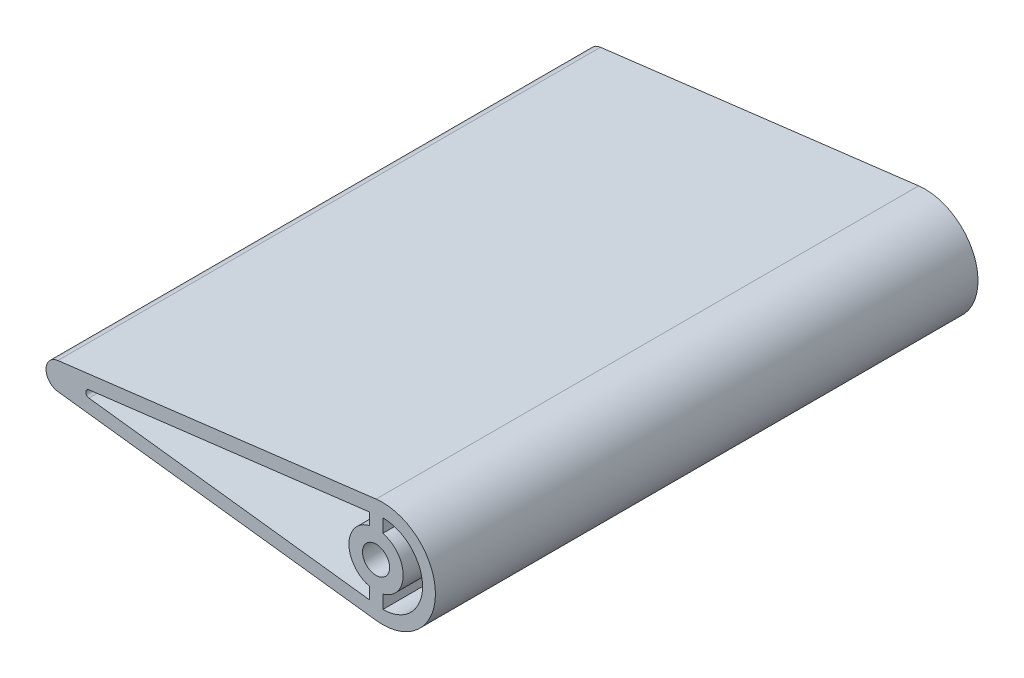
ISO-10303-21;
HEADER;
FILE_DESCRIPTION(('STEP AP214'),'2;1');
FILE_NAME('part.step','',(''),(''),'','','');
FILE_SCHEMA(('AUTOMOTIVE_DESIGN { 1 0 10303 214 1 1 1 1 }'));
ENDSEC;
DATA;
#1=APPLICATION_CONTEXT('core data for automotive mechanical design processes');
#2=APPLICATION_PROTOCOL_DEFINITION('international standard','automotive_design',2000,#1);
#3=PRODUCT_CONTEXT('',#1,'mechanical');
#4=PRODUCT('Part','Part','',(#3));
#5=PRODUCT_RELATED_PRODUCT_CATEGORY('part','',(#4));
#6=PRODUCT_DEFINITION_FORMATION('','',#4);
#7=PRODUCT_DEFINITION_CONTEXT('part definition',#1,'design');
#8=PRODUCT_DEFINITION('design','',#6,#7);
#9=PRODUCT_DEFINITION_SHAPE('','',#8);
#10=(LENGTH_UNIT() NAMED_UNIT(*) SI_UNIT(.MILLI.,.METRE.));
#11=(NAMED_UNIT(*) PLANE_ANGLE_UNIT() SI_UNIT($,.RADIAN.));
#12=(NAMED_UNIT(*) SI_UNIT($,.STERADIAN.) SOLID_ANGLE_UNIT());
#13=UNCERTAINTY_MEASURE_WITH_UNIT(LENGTH_MEASURE(1.E-05),#10,'distance_accuracy_value','');
#14=(GEOMETRIC_REPRESENTATION_CONTEXT(3) GLOBAL_UNCERTAINTY_ASSIGNED_CONTEXT((#13)) GLOBAL_UNIT_ASSIGNED_CONTEXT((#10,
#11,#12)) REPRESENTATION_CONTEXT('',''));
#15=CARTESIAN_POINT('',(0.,0.,0.));
#16=DIRECTION('',(0.,0.,1.));
#17=DIRECTION('',(1.,0.,0.));
#18=AXIS2_PLACEMENT_3D('',#15,#16,#17);
#19=CARTESIAN_POINT('',(1.42644334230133,0.,120.));
#20=DIRECTION('',(0.,0.,-1.));
#21=DIRECTION('',(-1.,0.,0.));
#22=AXIS2_PLACEMENT_3D('',#19,#20,#21);
#23=PLANE('',#22);
#24=CARTESIAN_POINT('',(0.,0.,120.));
#25=DIRECTION('',(0.,0.,1.));
#26=DIRECTION('',(-1.,0.,0.));
#27=AXIS2_PLACEMENT_3D('',#24,#25,#26);
#28=CIRCLE('',#27,3.);
#29=CARTESIAN_POINT('',(-3.,0.,120.));
#30=VERTEX_POINT('',#29);
#31=EDGE_CURVE('E173',#30,#30,#28,.T.);
#32=ORIENTED_EDGE('',*,*,#31,.F.);
#33=EDGE_LOOP('',(#32));
#34=FACE_BOUND('',#33,.T.);
#35=DIRECTION('',(-0.992546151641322,-0.121869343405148,0.));
#36=VECTOR('',#35,1.);
#37=CARTESIAN_POINT('',(-94.6165271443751,0.,120.));
#38=LINE('',#37,#36);
#39=CARTESIAN_POINT('',(0.,11.6174487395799,120.));
#40=VERTEX_POINT('',#39);
#41=CARTESIAN_POINT('',(-70.3656080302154,2.97763845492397,120.));
#42=VERTEX_POINT('',#41);
#43=EDGE_CURVE('E227',#40,#42,#38,.T.);
#44=ORIENTED_EDGE('',*,*,#43,.T.);
#45=CARTESIAN_POINT('',(-70.,0.,120.));
#46=DIRECTION('',(0.,0.,-1.));
#47=DIRECTION('',(-1.,0.,0.));
#48=AXIS2_PLACEMENT_3D('',#45,#46,#47);
#49=CIRCLE('',#48,3.);
#50=CARTESIAN_POINT('',(-70.3656080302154,-2.97763845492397,120.));
#51=VERTEX_POINT('',#50);
#52=EDGE_CURVE('E11',#42,#51,#49,.F.);
#53=ORIENTED_EDGE('',*,*,#52,.T.);
#54=DIRECTION('',(0.992546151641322,-0.121869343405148,0.));
#55=VECTOR('',#54,1.);
#56=CARTESIAN_POINT('',(-94.6165271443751,0.,120.));
#57=LINE('',#56,#55);
#58=CARTESIAN_POINT('',(0.,-11.6174487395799,120.));
#59=VERTEX_POINT('',#58);
#60=EDGE_CURVE('E230',#51,#59,#57,.T.);
#61=ORIENTED_EDGE('',*,*,#60,.T.);
#62=CARTESIAN_POINT('',(1.42644334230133,0.,120.));
#63=DIRECTION('',(0.,0.,1.));
#64=DIRECTION('',(-1.,0.,0.));
#65=AXIS2_PLACEMENT_3D('',#62,#63,#64);
#66=CIRCLE('',#65,11.7046937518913);
#67=EDGE_CURVE('E224',#59,#40,#66,.T.);
#68=ORIENTED_EDGE('',*,*,#67,.T.);
#69=EDGE_LOOP('',(#44,#53,#61,#68));
#70=FACE_BOUND('',#69,.T.);
#71=CARTESIAN_POINT('',(-63.3803395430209,0.,120.));
#72=DIRECTION('',(0.,0.,1.));
#73=DIRECTION('',(-1.,0.,0.));
#74=AXIS2_PLACEMENT_3D('',#71,#72,#73);
#75=CIRCLE('',#74,0.806945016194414);
#76=CARTESIAN_POINT('',(-63.496985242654,0.79846981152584,120.));
#77=VERTEX_POINT('',#76);
#78=CARTESIAN_POINT('',(-63.496985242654,-0.79846981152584,120.));
#79=VERTEX_POINT('',#78);
#80=EDGE_CURVE('E179',#77,#79,#75,.T.);
#81=ORIENTED_EDGE('',*,*,#80,.F.);
#82=DIRECTION('',(-0.992546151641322,-0.121869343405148,0.));
#83=VECTOR('',#82,1.);
#84=CARTESIAN_POINT('',(-63.496985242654,0.79846981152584,120.));
#85=LINE('',#84,#83);
#86=CARTESIAN_POINT('',(-1.5,8.41074242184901,120.));
#87=VERTEX_POINT('',#86);
#88=EDGE_CURVE('E191',#87,#77,#85,.T.);
#89=ORIENTED_EDGE('',*,*,#88,.F.);
#90=DIRECTION('',(0.,1.,0.));
#91=VECTOR('',#90,1.);
#92=CARTESIAN_POINT('',(-1.5,8.41074242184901,120.));
#93=LINE('',#92,#91);
#94=CARTESIAN_POINT('',(-1.5,5.80947501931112,120.));
#95=VERTEX_POINT('',#94);
#96=EDGE_CURVE('E188',#95,#87,#93,.T.);
#97=ORIENTED_EDGE('',*,*,#96,.F.);
#98=CARTESIAN_POINT('',(0.,0.,120.));
#99=DIRECTION('',(0.,0.,-1.));
#100=DIRECTION('',(1.,0.,0.));
#101=AXIS2_PLACEMENT_3D('',#98,#99,#100);
#102=CIRCLE('',#101,6.00000000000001);
#103=CARTESIAN_POINT('',(-1.50000000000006,-5.80947501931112,120.));
#104=VERTEX_POINT('',#103);
#105=EDGE_CURVE('E186',#104,#95,#102,.T.);
#106=ORIENTED_EDGE('',*,*,#105,.F.);
#107=DIRECTION('',(0.,1.,0.));
#108=VECTOR('',#107,1.);
#109=CARTESIAN_POINT('',(-1.50000000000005,-8.41074242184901,120.));
#110=LINE('',#109,#108);
#111=CARTESIAN_POINT('',(-1.50000000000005,-8.41074242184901,120.));
#112=VERTEX_POINT('',#111);
#113=EDGE_CURVE('E184',#112,#104,#110,.T.);
#114=ORIENTED_EDGE('',*,*,#113,.F.);
#115=DIRECTION('',(0.992546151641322,-0.121869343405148,0.));
#116=VECTOR('',#115,1.);
#117=CARTESIAN_POINT('',(-63.496985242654,-0.79846981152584,120.));
#118=LINE('',#117,#116);
#119=EDGE_CURVE('E181',#79,#112,#118,.T.);
#120=ORIENTED_EDGE('',*,*,#119,.F.);
#121=EDGE_LOOP('',(#81,#89,#97,#106,#114,#120));
#122=FACE_BOUND('',#121,.T.);
#123=CARTESIAN_POINT('',(1.49999999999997,0.,120.));
#124=DIRECTION('',(0.,0.,1.));
#125=DIRECTION('',(1.,0.,0.));
#126=AXIS2_PLACEMENT_3D('',#123,#124,#125);
#127=CIRCLE('',#126,8.77909610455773);
#128=CARTESIAN_POINT('',(1.49999999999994,-8.77909610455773,120.));
#129=VERTEX_POINT('',#128);
#130=CARTESIAN_POINT('',(1.5,8.77909610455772,120.));
#131=VERTEX_POINT('',#130);
#132=EDGE_CURVE('E132',#129,#131,#127,.T.);
#133=ORIENTED_EDGE('',*,*,#132,.F.);
#134=DIRECTION('',(0.,-1.,0.));
#135=VECTOR('',#134,1.);
#136=CARTESIAN_POINT('',(1.49999999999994,-8.77909610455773,120.));
#137=LINE('',#136,#135);
#138=CARTESIAN_POINT('',(1.49999999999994,-5.80947501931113,120.));
#139=VERTEX_POINT('',#138);
#140=EDGE_CURVE('E157',#139,#129,#137,.T.);
#141=ORIENTED_EDGE('',*,*,#140,.F.);
#142=CARTESIAN_POINT('',(0.,0.,120.));
#143=DIRECTION('',(0.,0.,-1.));
#144=DIRECTION('',(1.,0.,0.));
#145=AXIS2_PLACEMENT_3D('',#142,#143,#144);
#146=CIRCLE('',#145,5.99999999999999);
#147=CARTESIAN_POINT('',(1.5,5.80947501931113,120.));
#148=VERTEX_POINT('',#147);
#149=EDGE_CURVE('E155',#148,#139,#146,.T.);
#150=ORIENTED_EDGE('',*,*,#149,.F.);
#151=DIRECTION('',(0.,-1.,0.));
#152=VECTOR('',#151,1.);
#153=CARTESIAN_POINT('',(1.5,8.77909610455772,120.));
#154=LINE('',#153,#152);
#155=EDGE_CURVE('E142',#131,#148,#154,.T.);
#156=ORIENTED_EDGE('',*,*,#155,.F.);
#157=EDGE_LOOP('',(#133,#141,#150,#156));
#158=FACE_BOUND('',#157,.T.);
#159=ADVANCED_FACE('F32',(#34,#70,#122,#158),#23,.F.);
#160=CARTESIAN_POINT('',(1.42644334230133,0.,0.));
#161=DIRECTION('',(0.,0.,-1.));
#162=DIRECTION('',(-1.,0.,0.));
#163=AXIS2_PLACEMENT_3D('',#160,#161,#162);
#164=PLANE('',#163);
#165=CARTESIAN_POINT('',(0.,0.,0.));
#166=DIRECTION('',(0.,0.,1.));
#167=DIRECTION('',(-1.,0.,0.));
#168=AXIS2_PLACEMENT_3D('',#165,#166,#167);
#169=CIRCLE('',#168,3.);
#170=CARTESIAN_POINT('',(-3.,0.,0.));
#171=VERTEX_POINT('',#170);
#172=EDGE_CURVE('E150',#171,#171,#169,.T.);
#173=ORIENTED_EDGE('',*,*,#172,.T.);
#174=EDGE_LOOP('',(#173));
#175=FACE_BOUND('',#174,.T.);
#176=DIRECTION('',(0.992546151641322,-0.121869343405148,0.));
#177=VECTOR('',#176,1.);
#178=CARTESIAN_POINT('',(-94.6165271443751,0.,0.));
#179=LINE('',#178,#177);
#180=CARTESIAN_POINT('',(-70.3656080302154,-2.97763845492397,0.));
#181=VERTEX_POINT('',#180);
#182=CARTESIAN_POINT('',(0.,-11.6174487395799,0.));
#183=VERTEX_POINT('',#182);
#184=EDGE_CURVE('E228',#181,#183,#179,.T.);
#185=ORIENTED_EDGE('',*,*,#184,.F.);
#186=CARTESIAN_POINT('',(-70.,0.,0.));
#187=DIRECTION('',(0.,0.,-1.));
#188=DIRECTION('',(-1.,0.,0.));
#189=AXIS2_PLACEMENT_3D('',#186,#187,#188);
#190=CIRCLE('',#189,3.);
#191=CARTESIAN_POINT('',(-70.3656080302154,2.97763845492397,0.));
#192=VERTEX_POINT('',#191);
#193=EDGE_CURVE('E54',#181,#192,#190,.T.);
#194=ORIENTED_EDGE('',*,*,#193,.T.);
#195=DIRECTION('',(-0.992546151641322,-0.121869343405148,0.));
#196=VECTOR('',#195,1.);
#197=CARTESIAN_POINT('',(-94.6165271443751,0.,0.));
#198=LINE('',#197,#196);
#199=CARTESIAN_POINT('',(0.,11.6174487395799,0.));
#200=VERTEX_POINT('',#199);
#201=EDGE_CURVE('E235',#200,#192,#198,.T.);
#202=ORIENTED_EDGE('',*,*,#201,.F.);
#203=CARTESIAN_POINT('',(1.42644334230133,0.,0.));
#204=DIRECTION('',(0.,0.,1.));
#205=DIRECTION('',(-1.,0.,0.));
#206=AXIS2_PLACEMENT_3D('',#203,#204,#205);
#207=CIRCLE('',#206,11.7046937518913);
#208=EDGE_CURVE('E223',#183,#200,#207,.T.);
#209=ORIENTED_EDGE('',*,*,#208,.F.);
#210=EDGE_LOOP('',(#185,#194,#202,#209));
#211=FACE_BOUND('',#210,.T.);
#212=DIRECTION('',(-0.992546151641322,-0.121869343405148,0.));
#213=VECTOR('',#212,1.);
#214=CARTESIAN_POINT('',(-63.496985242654,0.79846981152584,0.));
#215=LINE('',#214,#213);
#216=CARTESIAN_POINT('',(-1.5,8.41074242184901,0.));
#217=VERTEX_POINT('',#216);
#218=CARTESIAN_POINT('',(-63.496985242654,0.798469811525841,0.));
#219=VERTEX_POINT('',#218);
#220=EDGE_CURVE('E182',#217,#219,#215,.T.);
#221=ORIENTED_EDGE('',*,*,#220,.T.);
#222=CARTESIAN_POINT('',(-63.3803395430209,0.,0.));
#223=DIRECTION('',(0.,0.,1.));
#224=DIRECTION('',(-1.,0.,0.));
#225=AXIS2_PLACEMENT_3D('',#222,#223,#224);
#226=CIRCLE('',#225,0.806945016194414);
#227=CARTESIAN_POINT('',(-63.496985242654,-0.79846981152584,0.));
#228=VERTEX_POINT('',#227);
#229=EDGE_CURVE('E176',#219,#228,#226,.T.);
#230=ORIENTED_EDGE('',*,*,#229,.T.);
#231=DIRECTION('',(0.992546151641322,-0.121869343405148,0.));
#232=VECTOR('',#231,1.);
#233=CARTESIAN_POINT('',(-63.496985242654,-0.79846981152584,0.));
#234=LINE('',#233,#232);
#235=CARTESIAN_POINT('',(-1.50000000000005,-8.41074242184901,0.));
#236=VERTEX_POINT('',#235);
#237=EDGE_CURVE('E196',#228,#236,#234,.T.);
#238=ORIENTED_EDGE('',*,*,#237,.T.);
#239=DIRECTION('',(0.,1.,0.));
#240=VECTOR('',#239,1.);
#241=CARTESIAN_POINT('',(-1.50000000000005,-8.41074242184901,0.));
#242=LINE('',#241,#240);
#243=CARTESIAN_POINT('',(-1.50000000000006,-5.80947501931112,0.));
#244=VERTEX_POINT('',#243);
#245=EDGE_CURVE('E199',#236,#244,#242,.T.);
#246=ORIENTED_EDGE('',*,*,#245,.T.);
#247=CARTESIAN_POINT('',(0.,0.,0.));
#248=DIRECTION('',(0.,0.,-1.));
#249=DIRECTION('',(1.,0.,0.));
#250=AXIS2_PLACEMENT_3D('',#247,#248,#249);
#251=CIRCLE('',#250,6.00000000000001);
#252=CARTESIAN_POINT('',(-1.5,5.80947501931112,0.));
#253=VERTEX_POINT('',#252);
#254=EDGE_CURVE('E202',#244,#253,#251,.T.);
#255=ORIENTED_EDGE('',*,*,#254,.T.);
#256=DIRECTION('',(0.,1.,0.));
#257=VECTOR('',#256,1.);
#258=CARTESIAN_POINT('',(-1.5,8.41074242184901,0.));
#259=LINE('',#258,#257);
#260=EDGE_CURVE('E205',#253,#217,#259,.T.);
#261=ORIENTED_EDGE('',*,*,#260,.T.);
#262=EDGE_LOOP('',(#221,#230,#238,#246,#255,#261));
#263=FACE_BOUND('',#262,.T.);
#264=DIRECTION('',(0.,-1.,0.));
#265=VECTOR('',#264,1.);
#266=CARTESIAN_POINT('',(1.49999999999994,-8.77909610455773,0.));
#267=LINE('',#266,#265);
#268=CARTESIAN_POINT('',(1.49999999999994,-5.80947501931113,0.));
#269=VERTEX_POINT('',#268);
#270=CARTESIAN_POINT('',(1.49999999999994,-8.77909610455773,0.));
#271=VERTEX_POINT('',#270);
#272=EDGE_CURVE('E143',#269,#271,#267,.T.);
#273=ORIENTED_EDGE('',*,*,#272,.T.);
#274=CARTESIAN_POINT('',(1.49999999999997,0.,0.));
#275=DIRECTION('',(0.,0.,1.));
#276=DIRECTION('',(1.,0.,0.));
#277=AXIS2_PLACEMENT_3D('',#274,#275,#276);
#278=CIRCLE('',#277,8.77909610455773);
#279=CARTESIAN_POINT('',(1.5,8.77909610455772,0.));
#280=VERTEX_POINT('',#279);
#281=EDGE_CURVE('E161',#271,#280,#278,.T.);
#282=ORIENTED_EDGE('',*,*,#281,.T.);
#283=DIRECTION('',(0.,-1.,0.));
#284=VECTOR('',#283,1.);
#285=CARTESIAN_POINT('',(1.5,8.77909610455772,0.));
#286=LINE('',#285,#284);
#287=CARTESIAN_POINT('',(1.5,5.80947501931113,0.));
#288=VERTEX_POINT('',#287);
#289=EDGE_CURVE('E149',#280,#288,#286,.T.);
#290=ORIENTED_EDGE('',*,*,#289,.T.);
#291=CARTESIAN_POINT('',(0.,0.,0.));
#292=DIRECTION('',(0.,0.,-1.));
#293=DIRECTION('',(1.,0.,0.));
#294=AXIS2_PLACEMENT_3D('',#291,#292,#293);
#295=CIRCLE('',#294,5.99999999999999);
#296=EDGE_CURVE('E164',#288,#269,#295,.T.);
#297=ORIENTED_EDGE('',*,*,#296,.T.);
#298=EDGE_LOOP('',(#273,#282,#290,#297));
#299=FACE_BOUND('',#298,.T.);
#300=ADVANCED_FACE('F254',(#175,#211,#263,#299),#164,.T.);
#301=CARTESIAN_POINT('',(1.42644334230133,0.,120.));
#302=DIRECTION('',(0.,0.,-1.));
#303=DIRECTION('',(-1.,0.,0.));
#304=AXIS2_PLACEMENT_3D('',#301,#302,#303);
#305=CYLINDRICAL_SURFACE('',#304,11.7046937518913);
#306=ORIENTED_EDGE('',*,*,#208,.T.);
#307=DIRECTION('',(0.,0.,-1.));
#308=VECTOR('',#307,1.);
#309=CARTESIAN_POINT('',(0.,11.6174487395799,120.));
#310=LINE('',#309,#308);
#311=EDGE_CURVE('E240',#40,#200,#310,.T.);
#312=ORIENTED_EDGE('',*,*,#311,.F.);
#313=ORIENTED_EDGE('',*,*,#67,.F.);
#314=DIRECTION('',(0.,0.,-1.));
#315=VECTOR('',#314,1.);
#316=CARTESIAN_POINT('',(0.,-11.6174487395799,120.));
#317=LINE('',#316,#315);
#318=EDGE_CURVE('E232',#59,#183,#317,.T.);
#319=ORIENTED_EDGE('',*,*,#318,.T.);
#320=EDGE_LOOP('',(#306,#312,#313,#319));
#321=FACE_BOUND('',#320,.T.);
#322=ADVANCED_FACE('F258',(#321),#305,.T.);
#323=CARTESIAN_POINT('',(-94.6165271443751,0.,120.));
#324=DIRECTION('',(0.121869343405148,-0.992546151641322,0.));
#325=DIRECTION('',(0.992546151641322,0.121869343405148,0.));
#326=AXIS2_PLACEMENT_3D('',#323,#324,#325);
#327=PLANE('',#326);
#328=ORIENTED_EDGE('',*,*,#201,.T.);
#329=DIRECTION('',(0.,0.,-1.));
#330=VECTOR('',#329,1.);
#331=CARTESIAN_POINT('',(-70.3656080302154,2.97763845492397,120.));
#332=LINE('',#331,#330);
#333=EDGE_CURVE('E40',#192,#42,#332,.F.);
#334=ORIENTED_EDGE('',*,*,#333,.T.);
#335=ORIENTED_EDGE('',*,*,#43,.F.);
#336=ORIENTED_EDGE('',*,*,#311,.T.);
#337=EDGE_LOOP('',(#328,#334,#335,#336));
#338=FACE_BOUND('',#337,.T.);
#339=ADVANCED_FACE('F285',(#338),#327,.F.);
#340=CARTESIAN_POINT('',(-94.6165271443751,0.,120.));
#341=DIRECTION('',(0.121869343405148,0.992546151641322,0.));
#342=DIRECTION('',(-0.992546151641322,0.121869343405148,0.));
#343=AXIS2_PLACEMENT_3D('',#340,#341,#342);
#344=PLANE('',#343);
#345=ORIENTED_EDGE('',*,*,#60,.F.);
#346=DIRECTION('',(0.,0.,-1.));
#347=VECTOR('',#346,1.);
#348=CARTESIAN_POINT('',(-70.3656080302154,-2.97763845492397,120.));
#349=LINE('',#348,#347);
#350=EDGE_CURVE('E243',#51,#181,#349,.T.);
#351=ORIENTED_EDGE('',*,*,#350,.T.);
#352=ORIENTED_EDGE('',*,*,#184,.T.);
#353=ORIENTED_EDGE('',*,*,#318,.F.);
#354=EDGE_LOOP('',(#345,#351,#352,#353));
#355=FACE_BOUND('',#354,.T.);
#356=ADVANCED_FACE('F249',(#355),#344,.F.);
#357=CARTESIAN_POINT('',(-63.3803395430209,0.,120.));
#358=DIRECTION('',(0.,0.,-1.));
#359=DIRECTION('',(-1.,0.,0.));
#360=AXIS2_PLACEMENT_3D('',#357,#358,#359);
#361=CYLINDRICAL_SURFACE('',#360,0.806945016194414);
#362=ORIENTED_EDGE('',*,*,#229,.F.);
#363=DIRECTION('',(0.,0.,-1.));
#364=VECTOR('',#363,1.);
#365=CARTESIAN_POINT('',(-63.496985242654,0.79846981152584,120.));
#366=LINE('',#365,#364);
#367=EDGE_CURVE('E193',#77,#219,#366,.T.);
#368=ORIENTED_EDGE('',*,*,#367,.F.);
#369=ORIENTED_EDGE('',*,*,#80,.T.);
#370=DIRECTION('',(0.,0.,-1.));
#371=VECTOR('',#370,1.);
#372=CARTESIAN_POINT('',(-63.496985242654,-0.79846981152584,120.));
#373=LINE('',#372,#371);
#374=EDGE_CURVE('E220',#79,#228,#373,.T.);
#375=ORIENTED_EDGE('',*,*,#374,.T.);
#376=EDGE_LOOP('',(#362,#368,#369,#375));
#377=FACE_BOUND('',#376,.T.);
#378=ADVANCED_FACE('F280',(#377),#361,.F.);
#379=CARTESIAN_POINT('',(-63.496985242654,-0.79846981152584,120.));
#380=DIRECTION('',(0.121869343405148,0.992546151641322,0.));
#381=DIRECTION('',(-0.992546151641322,0.121869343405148,0.));
#382=AXIS2_PLACEMENT_3D('',#379,#380,#381);
#383=PLANE('',#382);
#384=ORIENTED_EDGE('',*,*,#237,.F.);
#385=ORIENTED_EDGE('',*,*,#374,.F.);
#386=ORIENTED_EDGE('',*,*,#119,.T.);
#387=DIRECTION('',(0.,0.,-1.));
#388=VECTOR('',#387,1.);
#389=CARTESIAN_POINT('',(-1.50000000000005,-8.41074242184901,120.));
#390=LINE('',#389,#388);
#391=EDGE_CURVE('E218',#112,#236,#390,.T.);
#392=ORIENTED_EDGE('',*,*,#391,.T.);
#393=EDGE_LOOP('',(#384,#385,#386,#392));
#394=FACE_BOUND('',#393,.T.);
#395=ADVANCED_FACE('F306',(#394),#383,.T.);
#396=CARTESIAN_POINT('',(-1.50000000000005,-8.41074242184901,120.));
#397=DIRECTION('',(-1.,0.,0.));
#398=DIRECTION('',(0.,-1.,0.));
#399=AXIS2_PLACEMENT_3D('',#396,#397,#398);
#400=PLANE('',#399);
#401=ORIENTED_EDGE('',*,*,#245,.F.);
#402=ORIENTED_EDGE('',*,*,#391,.F.);
#403=ORIENTED_EDGE('',*,*,#113,.T.);
#404=DIRECTION('',(0.,0.,-1.));
#405=VECTOR('',#404,1.);
#406=CARTESIAN_POINT('',(-1.50000000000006,-5.80947501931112,120.));
#407=LINE('',#406,#405);
#408=EDGE_CURVE('E216',#104,#244,#407,.T.);
#409=ORIENTED_EDGE('',*,*,#408,.T.);
#410=EDGE_LOOP('',(#401,#402,#403,#409));
#411=FACE_BOUND('',#410,.T.);
#412=ADVANCED_FACE('F313',(#411),#400,.T.);
#413=CARTESIAN_POINT('',(0.,0.,120.));
#414=DIRECTION('',(0.,0.,-1.));
#415=DIRECTION('',(-1.,0.,0.));
#416=AXIS2_PLACEMENT_3D('',#413,#414,#415);
#417=CYLINDRICAL_SURFACE('',#416,6.00000000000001);
#418=ORIENTED_EDGE('',*,*,#254,.F.);
#419=ORIENTED_EDGE('',*,*,#408,.F.);
#420=ORIENTED_EDGE('',*,*,#105,.T.);
#421=DIRECTION('',(0.,0.,-1.));
#422=VECTOR('',#421,1.);
#423=CARTESIAN_POINT('',(-1.5,5.80947501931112,120.));
#424=LINE('',#423,#422);
#425=EDGE_CURVE('E214',#95,#253,#424,.T.);
#426=ORIENTED_EDGE('',*,*,#425,.T.);
#427=EDGE_LOOP('',(#418,#419,#420,#426));
#428=FACE_BOUND('',#427,.T.);
#429=ADVANCED_FACE('F320',(#428),#417,.T.);
#430=CARTESIAN_POINT('',(-1.5,8.41074242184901,120.));
#431=DIRECTION('',(-1.,0.,0.));
#432=DIRECTION('',(0.,-1.,0.));
#433=AXIS2_PLACEMENT_3D('',#430,#431,#432);
#434=PLANE('',#433);
#435=ORIENTED_EDGE('',*,*,#260,.F.);
#436=ORIENTED_EDGE('',*,*,#425,.F.);
#437=ORIENTED_EDGE('',*,*,#96,.T.);
#438=DIRECTION('',(0.,0.,-1.));
#439=VECTOR('',#438,1.);
#440=CARTESIAN_POINT('',(-1.5,8.41074242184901,120.));
#441=LINE('',#440,#439);
#442=EDGE_CURVE('E212',#87,#217,#441,.T.);
#443=ORIENTED_EDGE('',*,*,#442,.T.);
#444=EDGE_LOOP('',(#435,#436,#437,#443));
#445=FACE_BOUND('',#444,.T.);
#446=ADVANCED_FACE('F328',(#445),#434,.T.);
#447=CARTESIAN_POINT('',(-63.496985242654,0.79846981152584,120.));
#448=DIRECTION('',(0.121869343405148,-0.992546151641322,0.));
#449=DIRECTION('',(0.992546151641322,0.121869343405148,0.));
#450=AXIS2_PLACEMENT_3D('',#447,#448,#449);
#451=PLANE('',#450);
#452=ORIENTED_EDGE('',*,*,#220,.F.);
#453=ORIENTED_EDGE('',*,*,#442,.F.);
#454=ORIENTED_EDGE('',*,*,#88,.T.);
#455=ORIENTED_EDGE('',*,*,#367,.T.);
#456=EDGE_LOOP('',(#452,#453,#454,#455));
#457=FACE_BOUND('',#456,.T.);
#458=ADVANCED_FACE('F336',(#457),#451,.T.);
#459=CARTESIAN_POINT('',(0.,0.,120.));
#460=DIRECTION('',(0.,0.,-1.));
#461=DIRECTION('',(-1.,0.,0.));
#462=AXIS2_PLACEMENT_3D('',#459,#460,#461);
#463=CYLINDRICAL_SURFACE('',#462,3.);
#464=ORIENTED_EDGE('',*,*,#31,.T.);
#465=EDGE_LOOP('',(#464));
#466=FACE_BOUND('',#465,.T.);
#467=ORIENTED_EDGE('',*,*,#172,.F.);
#468=EDGE_LOOP('',(#467));
#469=FACE_BOUND('',#468,.T.);
#470=ADVANCED_FACE('F344',(#466,#469),#463,.F.);
#471=CARTESIAN_POINT('',(1.49999999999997,0.,120.));
#472=DIRECTION('',(0.,0.,-1.));
#473=DIRECTION('',(-1.,0.,0.));
#474=AXIS2_PLACEMENT_3D('',#471,#472,#473);
#475=CYLINDRICAL_SURFACE('',#474,8.77909610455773);
#476=ORIENTED_EDGE('',*,*,#281,.F.);
#477=DIRECTION('',(0.,0.,-1.));
#478=VECTOR('',#477,1.);
#479=CARTESIAN_POINT('',(1.49999999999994,-8.77909610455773,120.));
#480=LINE('',#479,#478);
#481=EDGE_CURVE('E138',#129,#271,#480,.T.);
#482=ORIENTED_EDGE('',*,*,#481,.F.);
#483=ORIENTED_EDGE('',*,*,#132,.T.);
#484=DIRECTION('',(0.,0.,-1.));
#485=VECTOR('',#484,1.);
#486=CARTESIAN_POINT('',(1.5,8.77909610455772,120.));
#487=LINE('',#486,#485);
#488=EDGE_CURVE('E135',#131,#280,#487,.T.);
#489=ORIENTED_EDGE('',*,*,#488,.T.);
#490=EDGE_LOOP('',(#476,#482,#483,#489));
#491=FACE_BOUND('',#490,.T.);
#492=ADVANCED_FACE('F134',(#491),#475,.F.);
#493=CARTESIAN_POINT('',(1.5,8.77909610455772,120.));
#494=DIRECTION('',(1.,0.,0.));
#495=DIRECTION('',(0.,1.,0.));
#496=AXIS2_PLACEMENT_3D('',#493,#494,#495);
#497=PLANE('',#496);
#498=ORIENTED_EDGE('',*,*,#289,.F.);
#499=ORIENTED_EDGE('',*,*,#488,.F.);
#500=ORIENTED_EDGE('',*,*,#155,.T.);
#501=DIRECTION('',(0.,0.,-1.));
#502=VECTOR('',#501,1.);
#503=CARTESIAN_POINT('',(1.5,5.80947501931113,120.));
#504=LINE('',#503,#502);
#505=EDGE_CURVE('E151',#148,#288,#504,.T.);
#506=ORIENTED_EDGE('',*,*,#505,.T.);
#507=EDGE_LOOP('',(#498,#499,#500,#506));
#508=FACE_BOUND('',#507,.T.);
#509=ADVANCED_FACE('F146',(#508),#497,.T.);
#510=CARTESIAN_POINT('',(0.,0.,120.));
#511=DIRECTION('',(0.,0.,-1.));
#512=DIRECTION('',(-1.,0.,0.));
#513=AXIS2_PLACEMENT_3D('',#510,#511,#512);
#514=CYLINDRICAL_SURFACE('',#513,5.99999999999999);
#515=ORIENTED_EDGE('',*,*,#296,.F.);
#516=ORIENTED_EDGE('',*,*,#505,.F.);
#517=ORIENTED_EDGE('',*,*,#149,.T.);
#518=DIRECTION('',(0.,0.,-1.));
#519=VECTOR('',#518,1.);
#520=CARTESIAN_POINT('',(1.49999999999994,-5.80947501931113,120.));
#521=LINE('',#520,#519);
#522=EDGE_CURVE('E170',#139,#269,#521,.T.);
#523=ORIENTED_EDGE('',*,*,#522,.T.);
#524=EDGE_LOOP('',(#515,#516,#517,#523));
#525=FACE_BOUND('',#524,.T.);
#526=ADVANCED_FACE('F267',(#525),#514,.T.);
#527=CARTESIAN_POINT('',(1.49999999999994,-8.77909610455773,120.));
#528=DIRECTION('',(1.,0.,0.));
#529=DIRECTION('',(0.,1.,0.));
#530=AXIS2_PLACEMENT_3D('',#527,#528,#529);
#531=PLANE('',#530);
#532=ORIENTED_EDGE('',*,*,#272,.F.);
#533=ORIENTED_EDGE('',*,*,#522,.F.);
#534=ORIENTED_EDGE('',*,*,#140,.T.);
#535=ORIENTED_EDGE('',*,*,#481,.T.);
#536=EDGE_LOOP('',(#532,#533,#534,#535));
#537=FACE_BOUND('',#536,.T.);
#538=ADVANCED_FACE('F263',(#537),#531,.T.);
#539=CARTESIAN_POINT('',(-70.,0.,120.));
#540=DIRECTION('',(0.,0.,-1.));
#541=DIRECTION('',(-1.,0.,0.));
#542=AXIS2_PLACEMENT_3D('',#539,#540,#541);
#543=CYLINDRICAL_SURFACE('',#542,3.);
#544=ORIENTED_EDGE('',*,*,#52,.F.);
#545=ORIENTED_EDGE('',*,*,#333,.F.);
#546=ORIENTED_EDGE('',*,*,#193,.F.);
#547=ORIENTED_EDGE('',*,*,#350,.F.);
#548=EDGE_LOOP('',(#544,#545,#546,#547));
#549=FACE_BOUND('',#548,.T.);
#550=ADVANCED_FACE('F34',(#549),#543,.T.);
#551=CLOSED_SHELL('',(#159,#300,#322,#339,#356,#378,#395,#412,#429,#446,#458,#470,#492,#509,
#526,#538,#550));
#552=MANIFOLD_SOLID_BREP('B2',#551);
#553=ADVANCED_BREP_SHAPE_REPRESENTATION('',(#18,#552),#14);
#554=SHAPE_DEFINITION_REPRESENTATION(#9,#553);
ENDSEC;
END-ISO-10303-21;
